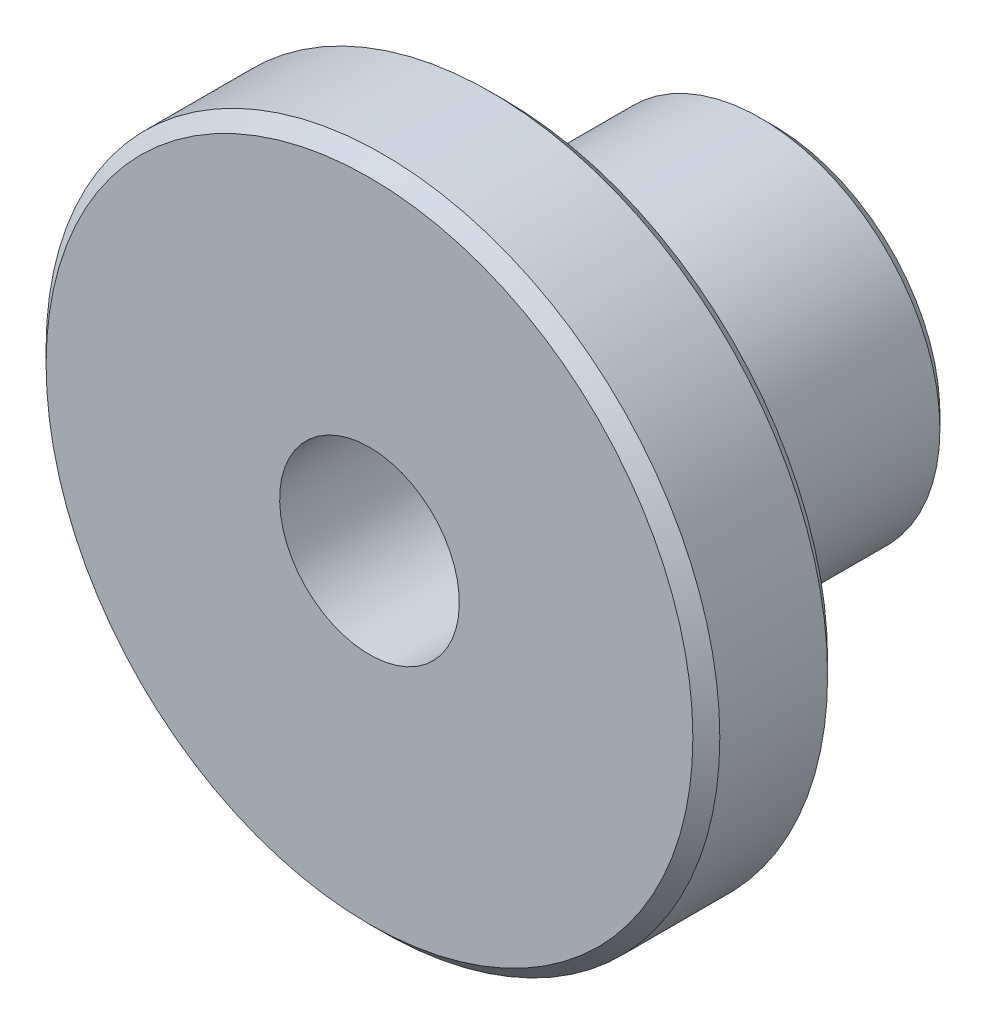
ISO-10303-21;
HEADER;
FILE_DESCRIPTION(('STEP AP214'),'2;1');
FILE_NAME('part.step','',(''),(''),'','','');
FILE_SCHEMA(('AUTOMOTIVE_DESIGN { 1 0 10303 214 1 1 1 1 }'));
ENDSEC;
DATA;
#1=APPLICATION_CONTEXT('core data for automotive mechanical design processes');
#2=APPLICATION_PROTOCOL_DEFINITION('international standard','automotive_design',2000,#1);
#3=PRODUCT_CONTEXT('',#1,'mechanical');
#4=PRODUCT('Part','Part','',(#3));
#5=PRODUCT_RELATED_PRODUCT_CATEGORY('part','',(#4));
#6=PRODUCT_DEFINITION_FORMATION('','',#4);
#7=PRODUCT_DEFINITION_CONTEXT('part definition',#1,'design');
#8=PRODUCT_DEFINITION('design','',#6,#7);
#9=PRODUCT_DEFINITION_SHAPE('','',#8);
#10=(LENGTH_UNIT() NAMED_UNIT(*) SI_UNIT(.MILLI.,.METRE.));
#11=(NAMED_UNIT(*) PLANE_ANGLE_UNIT() SI_UNIT($,.RADIAN.));
#12=(NAMED_UNIT(*) SI_UNIT($,.STERADIAN.) SOLID_ANGLE_UNIT());
#13=UNCERTAINTY_MEASURE_WITH_UNIT(LENGTH_MEASURE(1.E-05),#10,'distance_accuracy_value','');
#14=(GEOMETRIC_REPRESENTATION_CONTEXT(3) GLOBAL_UNCERTAINTY_ASSIGNED_CONTEXT((#13)) GLOBAL_UNIT_ASSIGNED_CONTEXT((#10,
#11,#12)) REPRESENTATION_CONTEXT('',''));
#15=CARTESIAN_POINT('',(0.,0.,0.));
#16=DIRECTION('',(0.,0.,1.));
#17=DIRECTION('',(1.,0.,0.));
#18=AXIS2_PLACEMENT_3D('',#15,#16,#17);
#19=CARTESIAN_POINT('',(0.,0.,0.));
#20=DIRECTION('',(0.,0.,-1.));
#21=DIRECTION('',(0.,1.,0.));
#22=AXIS2_PLACEMENT_3D('',#19,#20,#21);
#23=PLANE('',#22);
#24=CARTESIAN_POINT('',(0.,0.,0.));
#25=DIRECTION('',(0.,0.,-1.));
#26=DIRECTION('',(-1.,0.,0.));
#27=AXIS2_PLACEMENT_3D('',#24,#25,#26);
#28=CIRCLE('',#27,7.4);
#29=CARTESIAN_POINT('',(-7.4,0.,0.));
#30=VERTEX_POINT('',#29);
#31=EDGE_CURVE('E27',#30,#30,#28,.T.);
#32=ORIENTED_EDGE('',*,*,#31,.T.);
#33=EDGE_LOOP('',(#32));
#34=FACE_BOUND('',#33,.T.);
#35=CARTESIAN_POINT('',(0.,0.,0.));
#36=DIRECTION('',(0.,0.,-1.));
#37=DIRECTION('',(0.,1.,0.));
#38=AXIS2_PLACEMENT_3D('',#35,#36,#37);
#39=CIRCLE('',#38,4.);
#40=CARTESIAN_POINT('',(0.,4.,0.));
#41=VERTEX_POINT('',#40);
#42=EDGE_CURVE('E47',#41,#41,#39,.T.);
#43=ORIENTED_EDGE('',*,*,#42,.F.);
#44=EDGE_LOOP('',(#43));
#45=FACE_BOUND('',#44,.T.);
#46=ADVANCED_FACE('F12',(#34,#45),#23,.T.);
#47=CARTESIAN_POINT('',(0.,0.,-10.));
#48=DIRECTION('',(0.,0.,-1.));
#49=DIRECTION('',(0.,1.,0.));
#50=AXIS2_PLACEMENT_3D('',#47,#48,#49);
#51=CYLINDRICAL_SURFACE('',#50,8.);
#52=CARTESIAN_POINT('',(0.,0.,10.));
#53=DIRECTION('',(0.,0.,-1.));
#54=DIRECTION('',(-1.,0.,0.));
#55=AXIS2_PLACEMENT_3D('',#52,#53,#54);
#56=CIRCLE('',#55,8.);
#57=CARTESIAN_POINT('',(-8.,0.,10.));
#58=VERTEX_POINT('',#57);
#59=EDGE_CURVE('E19',#58,#58,#56,.T.);
#60=ORIENTED_EDGE('',*,*,#59,.T.);
#61=EDGE_LOOP('',(#60));
#62=FACE_BOUND('',#61,.T.);
#63=CARTESIAN_POINT('',(0.,0.,0.600000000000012));
#64=DIRECTION('',(0.,0.,-1.));
#65=DIRECTION('',(-1.,0.,0.));
#66=AXIS2_PLACEMENT_3D('',#63,#64,#65);
#67=CIRCLE('',#66,8.);
#68=CARTESIAN_POINT('',(-8.,0.,0.600000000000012));
#69=VERTEX_POINT('',#68);
#70=EDGE_CURVE('E23',#69,#69,#67,.F.);
#71=ORIENTED_EDGE('',*,*,#70,.T.);
#72=EDGE_LOOP('',(#71));
#73=FACE_BOUND('',#72,.T.);
#74=ADVANCED_FACE('F54',(#62,#73),#51,.T.);
#75=CARTESIAN_POINT('',(8.,0.,12.));
#76=DIRECTION('',(0.,0.,-1.));
#77=DIRECTION('',(0.,1.,0.));
#78=AXIS2_PLACEMENT_3D('',#75,#76,#77);
#79=PLANE('',#78);
#80=CARTESIAN_POINT('',(0.,0.,12.));
#81=DIRECTION('',(0.,0.,-1.));
#82=DIRECTION('',(-1.,0.,0.));
#83=AXIS2_PLACEMENT_3D('',#80,#81,#82);
#84=CIRCLE('',#83,10.);
#85=CARTESIAN_POINT('',(-10.,0.,12.));
#86=VERTEX_POINT('',#85);
#87=EDGE_CURVE('E8',#86,#86,#84,.F.);
#88=ORIENTED_EDGE('',*,*,#87,.T.);
#89=EDGE_LOOP('',(#88));
#90=FACE_BOUND('',#89,.T.);
#91=CARTESIAN_POINT('',(0.,0.,12.));
#92=DIRECTION('',(0.,0.,-1.));
#93=DIRECTION('',(-1.,0.,0.));
#94=AXIS2_PLACEMENT_3D('',#91,#92,#93);
#95=CIRCLE('',#94,14.4);
#96=CARTESIAN_POINT('',(-14.4,0.,12.));
#97=VERTEX_POINT('',#96);
#98=EDGE_CURVE('E41',#97,#97,#95,.T.);
#99=ORIENTED_EDGE('',*,*,#98,.T.);
#100=EDGE_LOOP('',(#99));
#101=FACE_BOUND('',#100,.T.);
#102=ADVANCED_FACE('F62',(#90,#101),#79,.T.);
#103=CARTESIAN_POINT('',(0.,0.,-10.));
#104=DIRECTION('',(0.,0.,-1.));
#105=DIRECTION('',(0.,1.,0.));
#106=AXIS2_PLACEMENT_3D('',#103,#104,#105);
#107=CYLINDRICAL_SURFACE('',#106,15.);
#108=CARTESIAN_POINT('',(0.,0.,12.6));
#109=DIRECTION('',(0.,0.,-1.));
#110=DIRECTION('',(-1.,0.,0.));
#111=AXIS2_PLACEMENT_3D('',#108,#109,#110);
#112=CIRCLE('',#111,15.);
#113=CARTESIAN_POINT('',(-15.,0.,12.6));
#114=VERTEX_POINT('',#113);
#115=EDGE_CURVE('E35',#114,#114,#112,.F.);
#116=ORIENTED_EDGE('',*,*,#115,.T.);
#117=EDGE_LOOP('',(#116));
#118=FACE_BOUND('',#117,.T.);
#119=CARTESIAN_POINT('',(0.,0.,17.4));
#120=DIRECTION('',(0.,0.,1.));
#121=DIRECTION('',(1.,0.,0.));
#122=AXIS2_PLACEMENT_3D('',#119,#120,#121);
#123=CIRCLE('',#122,15.);
#124=CARTESIAN_POINT('',(15.,0.,17.4));
#125=VERTEX_POINT('',#124);
#126=EDGE_CURVE('E38',#125,#125,#123,.F.);
#127=ORIENTED_EDGE('',*,*,#126,.T.);
#128=EDGE_LOOP('',(#127));
#129=FACE_BOUND('',#128,.T.);
#130=ADVANCED_FACE('F117',(#118,#129),#107,.T.);
#131=CARTESIAN_POINT('',(15.,0.,18.));
#132=DIRECTION('',(0.,0.,1.));
#133=DIRECTION('',(0.,-1.,0.));
#134=AXIS2_PLACEMENT_3D('',#131,#132,#133);
#135=PLANE('',#134);
#136=CARTESIAN_POINT('',(0.,0.,18.));
#137=DIRECTION('',(0.,0.,1.));
#138=DIRECTION('',(1.,0.,0.));
#139=AXIS2_PLACEMENT_3D('',#136,#137,#138);
#140=CIRCLE('',#139,14.4);
#141=CARTESIAN_POINT('',(14.4,0.,18.));
#142=VERTEX_POINT('',#141);
#143=EDGE_CURVE('E32',#142,#142,#140,.T.);
#144=ORIENTED_EDGE('',*,*,#143,.T.);
#145=EDGE_LOOP('',(#144));
#146=FACE_BOUND('',#145,.T.);
#147=CARTESIAN_POINT('',(0.,0.,18.));
#148=DIRECTION('',(0.,0.,-1.));
#149=DIRECTION('',(0.,1.,0.));
#150=AXIS2_PLACEMENT_3D('',#147,#148,#149);
#151=CIRCLE('',#150,4.);
#152=CARTESIAN_POINT('',(0.,4.,18.));
#153=VERTEX_POINT('',#152);
#154=EDGE_CURVE('E44',#153,#153,#151,.T.);
#155=ORIENTED_EDGE('',*,*,#154,.T.);
#156=EDGE_LOOP('',(#155));
#157=FACE_BOUND('',#156,.T.);
#158=ADVANCED_FACE('F106',(#146,#157),#135,.T.);
#159=CARTESIAN_POINT('',(0.,0.,18.));
#160=DIRECTION('',(0.,0.,-1.));
#161=DIRECTION('',(0.,1.,0.));
#162=AXIS2_PLACEMENT_3D('',#159,#160,#161);
#163=CYLINDRICAL_SURFACE('',#162,4.);
#164=ORIENTED_EDGE('',*,*,#154,.F.);
#165=EDGE_LOOP('',(#164));
#166=FACE_BOUND('',#165,.T.);
#167=ORIENTED_EDGE('',*,*,#42,.T.);
#168=EDGE_LOOP('',(#167));
#169=FACE_BOUND('',#168,.T.);
#170=ADVANCED_FACE('F51',(#166,#169),#163,.F.);
#171=CARTESIAN_POINT('',(0.,0.,12.));
#172=DIRECTION('',(0.,0.,1.));
#173=DIRECTION('',(1.,0.,0.));
#174=AXIS2_PLACEMENT_3D('',#171,#172,#173);
#175=CONICAL_SURFACE('',#174,14.4,0.785398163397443);
#176=ORIENTED_EDGE('',*,*,#115,.F.);
#177=EDGE_LOOP('',(#176));
#178=FACE_BOUND('',#177,.T.);
#179=ORIENTED_EDGE('',*,*,#98,.F.);
#180=EDGE_LOOP('',(#179));
#181=FACE_BOUND('',#180,.T.);
#182=ADVANCED_FACE('F66',(#178,#181),#175,.T.);
#183=CARTESIAN_POINT('',(0.,0.,17.4));
#184=DIRECTION('',(0.,0.,-1.));
#185=DIRECTION('',(-1.,0.,0.));
#186=AXIS2_PLACEMENT_3D('',#183,#184,#185);
#187=CONICAL_SURFACE('',#186,15.,0.785398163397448);
#188=ORIENTED_EDGE('',*,*,#143,.F.);
#189=EDGE_LOOP('',(#188));
#190=FACE_BOUND('',#189,.T.);
#191=ORIENTED_EDGE('',*,*,#126,.F.);
#192=EDGE_LOOP('',(#191));
#193=FACE_BOUND('',#192,.T.);
#194=ADVANCED_FACE('F69',(#190,#193),#187,.T.);
#195=CARTESIAN_POINT('',(0.,0.,0.));
#196=DIRECTION('',(0.,0.,1.));
#197=DIRECTION('',(1.,0.,0.));
#198=AXIS2_PLACEMENT_3D('',#195,#196,#197);
#199=CONICAL_SURFACE('',#198,7.4,0.785398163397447);
#200=ORIENTED_EDGE('',*,*,#70,.F.);
#201=EDGE_LOOP('',(#200));
#202=FACE_BOUND('',#201,.T.);
#203=ORIENTED_EDGE('',*,*,#31,.F.);
#204=EDGE_LOOP('',(#203));
#205=FACE_BOUND('',#204,.T.);
#206=ADVANCED_FACE('F72',(#202,#205),#199,.T.);
#207=CARTESIAN_POINT('',(0.,0.,10.));
#208=DIRECTION('',(0.,0.,-1.));
#209=DIRECTION('',(-1.,0.,0.));
#210=AXIS2_PLACEMENT_3D('',#207,#208,#209);
#211=TOROIDAL_SURFACE('',#210,10.,2.);
#212=ORIENTED_EDGE('',*,*,#87,.F.);
#213=EDGE_LOOP('',(#212));
#214=FACE_BOUND('',#213,.T.);
#215=ORIENTED_EDGE('',*,*,#59,.F.);
#216=EDGE_LOOP('',(#215));
#217=FACE_BOUND('',#216,.T.);
#218=ADVANCED_FACE('F14',(#214,#217),#211,.F.);
#219=CLOSED_SHELL('',(#46,#74,#102,#130,#158,#170,#182,#194,#206,#218));
#220=MANIFOLD_SOLID_BREP('B1',#219);
#221=ADVANCED_BREP_SHAPE_REPRESENTATION('',(#18,#220),#14);
#222=SHAPE_DEFINITION_REPRESENTATION(#9,#221);
ENDSEC;
END-ISO-10303-21;
